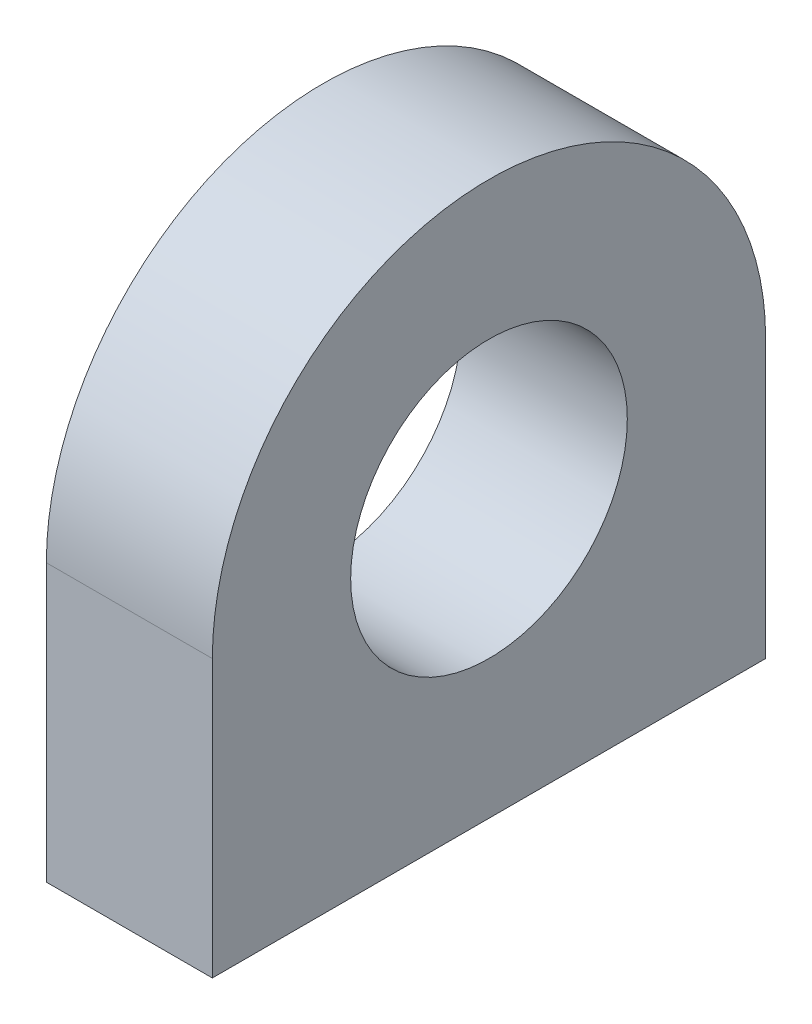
from build123d import *

# Parameters (mm, degrees)
SKETCH4_R       = 25
EXTRUDE_1_DEPTH = 30


with BuildPart() as part:
    # Sketch4 → Extrude 1 (new body)
    with BuildSketch(Plane(origin=(0, 0, 0), x_dir=(0, 0, -1), z_dir=(1, 0, 0))):
        with BuildLine():
            Line((50, 0), (-50, 0))
            Line((-50, 0), (-50, 50))
            ThreePointArc((-50, 50), (0, 100), (50, 50))
            Line((50, 50), (50, 0))
        make_face()
        with Locations((0, 50)):
            Circle(SKETCH4_R, mode=Mode.SUBTRACT)
    extrude(amount=EXTRUDE_1_DEPTH)


solid = part.part
